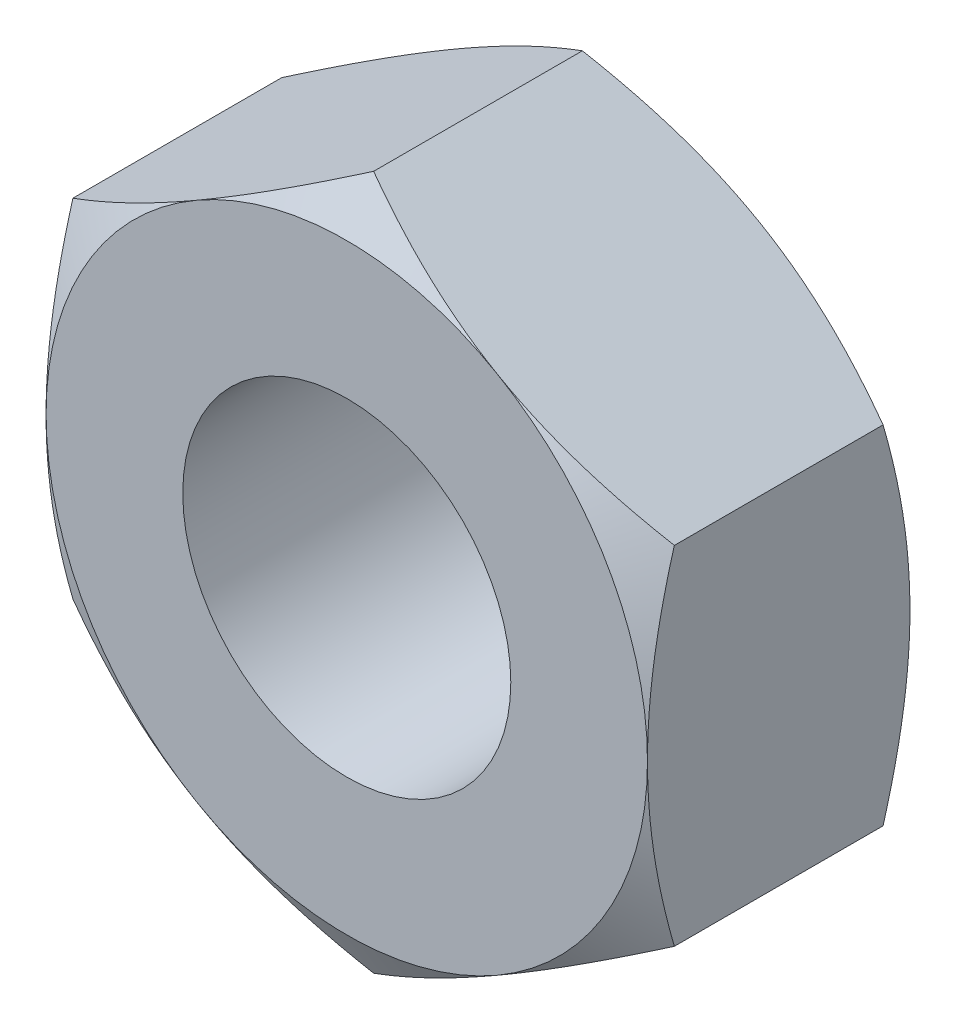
ISO-10303-21;
HEADER;
FILE_DESCRIPTION(('STEP AP214'),'2;1');
FILE_NAME('part.step','',(''),(''),'','','');
FILE_SCHEMA(('AUTOMOTIVE_DESIGN { 1 0 10303 214 1 1 1 1 }'));
ENDSEC;
DATA;
#1=APPLICATION_CONTEXT('core data for automotive mechanical design processes');
#2=APPLICATION_PROTOCOL_DEFINITION('international standard','automotive_design',2000,#1);
#3=PRODUCT_CONTEXT('',#1,'mechanical');
#4=PRODUCT('Part','Part','',(#3));
#5=PRODUCT_RELATED_PRODUCT_CATEGORY('part','',(#4));
#6=PRODUCT_DEFINITION_FORMATION('','',#4);
#7=PRODUCT_DEFINITION_CONTEXT('part definition',#1,'design');
#8=PRODUCT_DEFINITION('design','',#6,#7);
#9=PRODUCT_DEFINITION_SHAPE('','',#8);
#10=(LENGTH_UNIT() NAMED_UNIT(*) SI_UNIT(.MILLI.,.METRE.));
#11=(NAMED_UNIT(*) PLANE_ANGLE_UNIT() SI_UNIT($,.RADIAN.));
#12=(NAMED_UNIT(*) SI_UNIT($,.STERADIAN.) SOLID_ANGLE_UNIT());
#13=UNCERTAINTY_MEASURE_WITH_UNIT(LENGTH_MEASURE(1.E-05),#10,'distance_accuracy_value','');
#14=(GEOMETRIC_REPRESENTATION_CONTEXT(3) GLOBAL_UNCERTAINTY_ASSIGNED_CONTEXT((#13)) GLOBAL_UNIT_ASSIGNED_CONTEXT((#10,
#11,#12)) REPRESENTATION_CONTEXT('',''));
#15=CARTESIAN_POINT('',(0.,0.,0.));
#16=DIRECTION('',(0.,0.,1.));
#17=DIRECTION('',(1.,0.,0.));
#18=AXIS2_PLACEMENT_3D('',#15,#16,#17);
#19=CARTESIAN_POINT('',(-2.75,4.76313972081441,0.));
#20=DIRECTION('',(0.,0.,-1.));
#21=DIRECTION('',(-1.,0.,0.));
#22=AXIS2_PLACEMENT_3D('',#19,#20,#21);
#23=PLANE('',#22);
#24=CARTESIAN_POINT('',(0.,0.,0.));
#25=DIRECTION('',(0.,0.,1.));
#26=DIRECTION('',(1.,0.,0.));
#27=AXIS2_PLACEMENT_3D('',#24,#25,#26);
#28=CIRCLE('',#27,1.5);
#29=CARTESIAN_POINT('',(1.5,0.,0.));
#30=VERTEX_POINT('',#29);
#31=EDGE_CURVE('E331',#30,#30,#28,.T.);
#32=ORIENTED_EDGE('',*,*,#31,.F.);
#33=EDGE_LOOP('',(#32));
#34=FACE_BOUND('',#33,.T.);
#35=CARTESIAN_POINT('',(0.,0.,0.));
#36=DIRECTION('',(0.,0.,-1.));
#37=DIRECTION('',(-1.,0.,0.));
#38=AXIS2_PLACEMENT_3D('',#35,#36,#37);
#39=CIRCLE('',#38,2.75);
#40=CARTESIAN_POINT('',(-2.75,0.,0.));
#41=VERTEX_POINT('',#40);
#42=CARTESIAN_POINT('',(-1.375,2.38156986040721,0.));
#43=VERTEX_POINT('',#42);
#44=EDGE_CURVE('E339',#41,#43,#39,.T.);
#45=ORIENTED_EDGE('',*,*,#44,.F.);
#46=CARTESIAN_POINT('',(0.,0.,0.));
#47=DIRECTION('',(0.,0.,-1.));
#48=DIRECTION('',(-1.,0.,0.));
#49=AXIS2_PLACEMENT_3D('',#46,#47,#48);
#50=CIRCLE('',#49,2.75);
#51=CARTESIAN_POINT('',(-1.375,-2.38156986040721,0.));
#52=VERTEX_POINT('',#51);
#53=EDGE_CURVE('E149',#41,#52,#50,.F.);
#54=ORIENTED_EDGE('',*,*,#53,.T.);
#55=CARTESIAN_POINT('',(1.375,-2.38156986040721,0.));
#56=VERTEX_POINT('',#55);
#57=EDGE_CURVE('E260',#52,#56,#50,.F.);
#58=ORIENTED_EDGE('',*,*,#57,.T.);
#59=CARTESIAN_POINT('',(2.75,0.,0.));
#60=VERTEX_POINT('',#59);
#61=EDGE_CURVE('E152',#56,#60,#50,.F.);
#62=ORIENTED_EDGE('',*,*,#61,.T.);
#63=CARTESIAN_POINT('',(1.375,2.38156986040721,0.));
#64=VERTEX_POINT('',#63);
#65=EDGE_CURVE('E127',#60,#64,#50,.F.);
#66=ORIENTED_EDGE('',*,*,#65,.T.);
#67=EDGE_CURVE('E140',#64,#43,#50,.F.);
#68=ORIENTED_EDGE('',*,*,#67,.T.);
#69=EDGE_LOOP('',(#45,#54,#58,#62,#66,#68));
#70=FACE_BOUND('',#69,.T.);
#71=ADVANCED_FACE('F32',(#34,#70),#23,.F.);
#72=CARTESIAN_POINT('',(0.,0.,0.));
#73=DIRECTION('',(0.,0.,-1.));
#74=DIRECTION('',(-1.,0.,0.));
#75=AXIS2_PLACEMENT_3D('',#72,#73,#74);
#76=CONICAL_SURFACE('',#75,2.75,1.0471975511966);
#77=CARTESIAN_POINT('',(-2.75,-4.34466851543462,-1.38093653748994));
#78=CARTESIAN_POINT('',(-2.75,-4.22386779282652,-1.32202064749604));
#79=CARTESIAN_POINT('',(-2.75,-4.10279820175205,-1.26364700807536));
#80=CARTESIAN_POINT('',(-2.75,-3.85997859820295,-1.14828767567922));
#81=CARTESIAN_POINT('',(-2.75,-3.73822848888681,-1.09130218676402));
#82=CARTESIAN_POINT('',(-2.75,-3.49331526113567,-0.978752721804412));
#83=CARTESIAN_POINT('',(-2.75,-3.37014810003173,-0.923197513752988));
#84=CARTESIAN_POINT('',(-2.75,-3.12286173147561,-0.814256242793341));
#85=CARTESIAN_POINT('',(-2.75,-2.99874256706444,-0.760870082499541));
#86=CARTESIAN_POINT('',(-2.75,-2.74504756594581,-0.655040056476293));
#87=CARTESIAN_POINT('',(-2.75,-2.61543135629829,-0.602692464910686));
#88=CARTESIAN_POINT('',(-2.75,-2.35471222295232,-0.501769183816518));
#89=CARTESIAN_POINT('',(-2.75,-2.22360913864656,-0.453193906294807));
#90=CARTESIAN_POINT('',(-2.75,-1.95992838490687,-0.36103232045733));
#91=CARTESIAN_POINT('',(-2.75,-1.82735405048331,-0.317436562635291));
#92=CARTESIAN_POINT('',(-2.75,-1.56030503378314,-0.236579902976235));
#93=CARTESIAN_POINT('',(-2.75,-1.42583093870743,-0.199317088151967));
#94=CARTESIAN_POINT('',(-2.75,-1.1556720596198,-0.133064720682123));
#95=CARTESIAN_POINT('',(-2.75,-1.01999923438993,-0.104027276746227));
#96=CARTESIAN_POINT('',(-2.75,-0.746885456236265,-0.0558064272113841));
#97=CARTESIAN_POINT('',(-2.75,-0.609444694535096,-0.036621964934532));
#98=CARTESIAN_POINT('',(-2.75,-0.335308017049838,-0.00988438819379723));
#99=CARTESIAN_POINT('',(-2.75,-0.198627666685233,-0.00217562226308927));
#100=CARTESIAN_POINT('',(-2.75,0.0749013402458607,0.00137225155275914));
#101=CARTESIAN_POINT('',(-2.75,0.211749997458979,-0.00278868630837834));
#102=CARTESIAN_POINT('',(-2.75,0.441773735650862,-0.0194575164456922));
#103=CARTESIAN_POINT('',(-2.75,0.53518371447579,-0.0289378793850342));
#104=CARTESIAN_POINT('',(-2.75,0.721369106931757,-0.0528801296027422));
#105=CARTESIAN_POINT('',(-2.75,0.814144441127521,-0.0673426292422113));
#106=CARTESIAN_POINT('',(-2.75,1.09135512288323,-0.117450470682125));
#107=CARTESIAN_POINT('',(-2.75,1.27458276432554,-0.159808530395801));
#108=CARTESIAN_POINT('',(-2.75,1.64148663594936,-0.258901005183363));
#109=CARTESIAN_POINT('',(-2.75,1.82507634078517,-0.315943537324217));
#110=CARTESIAN_POINT('',(-2.75,2.09789706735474,-0.408810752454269));
#111=CARTESIAN_POINT('',(-2.75,2.18840332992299,-0.440981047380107));
#112=CARTESIAN_POINT('',(-2.75,2.36865794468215,-0.507377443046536));
#113=CARTESIAN_POINT('',(-2.75,2.45840631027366,-0.541603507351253));
#114=CARTESIAN_POINT('',(-2.75,2.68603060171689,-0.630917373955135));
#115=CARTESIAN_POINT('',(-2.75,2.82343831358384,-0.687195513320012));
#116=CARTESIAN_POINT('',(-2.75,3.09693392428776,-0.802882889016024));
#117=CARTESIAN_POINT('',(-2.75,3.23302170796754,-0.862292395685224));
#118=CARTESIAN_POINT('',(-2.75,3.50414954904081,-0.983551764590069));
#119=CARTESIAN_POINT('',(-2.75,3.63918929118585,-1.04540232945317));
#120=CARTESIAN_POINT('',(-2.75,3.90838030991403,-1.17101091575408));
#121=CARTESIAN_POINT('',(-2.75,4.0425315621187,-1.23476898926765));
#122=CARTESIAN_POINT('',(-2.75,4.44426655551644,-1.42847314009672));
#123=CARTESIAN_POINT('',(-2.75,4.71075917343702,-1.56067980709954));
#124=CARTESIAN_POINT('',(-2.75,5.24170253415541,-1.82899066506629));
#125=CARTESIAN_POINT('',(-2.75,5.50615362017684,-1.96509418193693));
#126=CARTESIAN_POINT('',(-2.75,6.00831212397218,-2.22681256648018));
#127=CARTESIAN_POINT('',(-2.75,6.24614899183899,-2.35217951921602));
#128=CARTESIAN_POINT('',(-2.75,6.72096497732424,-2.60455330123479));
#129=CARTESIAN_POINT('',(-2.75,6.95794405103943,-2.73156021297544));
#130=CARTESIAN_POINT('',(-2.75,7.43050912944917,-2.986411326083));
#131=CARTESIAN_POINT('',(-2.75,7.66609717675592,-3.11425174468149));
#132=CARTESIAN_POINT('',(-2.75,8.13673290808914,-3.37088488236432));
#133=CARTESIAN_POINT('',(-2.75,8.37178062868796,-3.4996775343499));
#134=CARTESIAN_POINT('',(-2.75,8.60663455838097,-3.62882004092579));
#135=B_SPLINE_CURVE_WITH_KNOTS('',3,(#77,#78,#79,#80,#81,#82,#83,#84,#85,#86,#87,#88,#89,#90,
#91,#92,#93,#94,#95,#96,#97,#98,#99,#100,#101,#102,#103,#104,#105,#106,#107,#108,#109,#110,#111,
#112,#113,#114,#115,#116,#117,#118,#119,#120,#121,#122,#123,#124,#125,#126,#127,#128,#129,#130,
#131,#132,#133,#134),.UNSPECIFIED.,.F.,.F.,(4,2,2,2,2,2,2,2,2,2,2,2,2,2,2,2,2,2,2,2,2,2,2,2,2,2,
2,2,4),(0.,0.403210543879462,0.806480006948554,1.21181340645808,1.61712858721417,
2.03644659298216,2.45581033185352,2.8743645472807,3.29279210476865,3.70873084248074,
4.12462496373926,4.53482497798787,4.94502657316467,5.22656209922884,5.5081322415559,
6.07154931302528,6.64791900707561,6.9360607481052,7.22419738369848,7.66960136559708,
8.11504386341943,8.56061552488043,9.00619936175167,9.89859387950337,10.7908349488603,
11.5973926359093,12.4039910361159,13.2081055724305,14.0121639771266),.UNSPECIFIED.);
#136=CARTESIAN_POINT('',(-2.75,1.58771324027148,-0.245620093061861));
#137=VERTEX_POINT('',#136);
#138=EDGE_CURVE('E157',#137,#41,#135,.F.);
#139=ORIENTED_EDGE('',*,*,#138,.T.);
#140=ORIENTED_EDGE('',*,*,#44,.T.);
#141=CARTESIAN_POINT('',(0.000199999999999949,3.17554195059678,-0.245686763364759));
#142=CARTESIAN_POINT('',(-0.120649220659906,3.10576962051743,-0.205387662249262));
#143=CARTESIAN_POINT('',(-0.242541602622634,3.03539502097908,-0.168736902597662));
#144=CARTESIAN_POINT('',(-0.488437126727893,2.89342717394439,-0.104762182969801));
#145=CARTESIAN_POINT('',(-0.612444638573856,2.82183140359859,-0.0774608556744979));
#146=CARTESIAN_POINT('',(-0.858922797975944,2.67952717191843,-0.0349617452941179));
#147=CARTESIAN_POINT('',(-0.981355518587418,2.60884060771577,-0.0194811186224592));
#148=CARTESIAN_POINT('',(-1.22679714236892,2.46713482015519,-0.000999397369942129));
#149=CARTESIAN_POINT('',(-1.34980515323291,2.39611611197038,0.00201700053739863));
#150=CARTESIAN_POINT('',(-1.57965878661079,2.26341005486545,-0.0042531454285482));
#151=CARTESIAN_POINT('',(-1.68653879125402,2.20170285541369,-0.0120001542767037));
#152=CARTESIAN_POINT('',(-1.89960246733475,2.07869048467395,-0.0365551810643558));
#153=CARTESIAN_POINT('',(-2.00578540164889,2.01738573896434,-0.0533715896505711));
#154=CARTESIAN_POINT('',(-2.21928848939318,1.89411967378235,-0.0954119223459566));
#155=CARTESIAN_POINT('',(-2.32658161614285,1.83217395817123,-0.120814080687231));
#156=CARTESIAN_POINT('',(-2.53956747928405,1.70920651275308,-0.178467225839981));
#157=CARTESIAN_POINT('',(-2.64526294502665,1.64818320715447,-0.210704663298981));
#158=CARTESIAN_POINT('',(-2.7502,1.58759777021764,-0.245686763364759));
#159=B_SPLINE_CURVE_WITH_KNOTS('',3,(#141,#142,#143,#144,#145,#146,#147,#148,#149,#150,#151,
#152,#153,#154,#155,#156,#157,#158),.UNSPECIFIED.,.F.,.F.,(4,2,2,2,2,2,2,2,4),(0.,
0.435912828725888,0.872873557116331,1.29901931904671,1.72464171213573,2.09526089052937,
2.46622354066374,2.84541551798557,3.22386274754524),.UNSPECIFIED.);
#160=EDGE_CURVE('E192',#43,#137,#159,.T.);
#161=ORIENTED_EDGE('',*,*,#160,.T.);
#162=EDGE_LOOP('',(#139,#140,#161));
#163=FACE_BOUND('',#162,.T.);
#164=ADVANCED_FACE('F179',(#163),#76,.T.);
#165=CARTESIAN_POINT('',(2.7502,1.58759777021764,-0.245686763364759));
#166=CARTESIAN_POINT('',(2.62935077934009,1.65737010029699,-0.205387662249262));
#167=CARTESIAN_POINT('',(2.50745839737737,1.72774469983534,-0.168736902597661));
#168=CARTESIAN_POINT('',(2.26156287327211,1.86971254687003,-0.104762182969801));
#169=CARTESIAN_POINT('',(2.13755536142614,1.94130831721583,-0.0774608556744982));
#170=CARTESIAN_POINT('',(1.89107720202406,2.08361254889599,-0.0349617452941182));
#171=CARTESIAN_POINT('',(1.76864448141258,2.15429911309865,-0.0194811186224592));
#172=CARTESIAN_POINT('',(1.52320285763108,2.29600490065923,-0.000999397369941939));
#173=CARTESIAN_POINT('',(1.40019484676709,2.36702360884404,0.00201700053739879));
#174=CARTESIAN_POINT('',(1.17034121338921,2.49972966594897,-0.00425314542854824));
#175=CARTESIAN_POINT('',(1.06346120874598,2.56143686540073,-0.0120001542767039));
#176=CARTESIAN_POINT('',(0.85039753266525,2.68444923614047,-0.0365551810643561));
#177=CARTESIAN_POINT('',(0.744214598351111,2.74575398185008,-0.0533715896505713));
#178=CARTESIAN_POINT('',(0.530711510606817,2.86902004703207,-0.0954119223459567));
#179=CARTESIAN_POINT('',(0.423418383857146,2.93096576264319,-0.120814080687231));
#180=CARTESIAN_POINT('',(0.210432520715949,3.05393320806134,-0.178467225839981));
#181=CARTESIAN_POINT('',(0.104737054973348,3.11495651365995,-0.210704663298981));
#182=CARTESIAN_POINT('',(-0.000199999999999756,3.17554195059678,-0.245686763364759));
#183=B_SPLINE_CURVE_WITH_KNOTS('',3,(#165,#166,#167,#168,#169,#170,#171,#172,#173,#174,#175,
#176,#177,#178,#179,#180,#181,#182),.UNSPECIFIED.,.F.,.F.,(4,2,2,2,2,2,2,2,4),(0.,
0.435912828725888,0.872873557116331,1.29901931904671,1.72464171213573,2.09526089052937,
2.46622354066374,2.84541551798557,3.22386274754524),.UNSPECIFIED.);
#184=CARTESIAN_POINT('',(0.,3.17542648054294,-0.245620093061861));
#185=VERTEX_POINT('',#184);
#186=EDGE_CURVE('E136',#64,#185,#183,.T.);
#187=ORIENTED_EDGE('',*,*,#186,.T.);
#188=EDGE_CURVE('E143',#185,#43,#159,.T.);
#189=ORIENTED_EDGE('',*,*,#188,.T.);
#190=ORIENTED_EDGE('',*,*,#67,.F.);
#191=EDGE_LOOP('',(#187,#189,#190));
#192=FACE_BOUND('',#191,.T.);
#193=ADVANCED_FACE('F141',(#192),#76,.T.);
#194=CARTESIAN_POINT('',(2.75,-4.34466851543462,-1.38093653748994));
#195=CARTESIAN_POINT('',(2.75,-4.22386779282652,-1.32202064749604));
#196=CARTESIAN_POINT('',(2.75,-4.10279820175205,-1.26364700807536));
#197=CARTESIAN_POINT('',(2.75,-3.85997859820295,-1.14828767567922));
#198=CARTESIAN_POINT('',(2.75,-3.73822848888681,-1.09130218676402));
#199=CARTESIAN_POINT('',(2.75,-3.49331526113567,-0.978752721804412));
#200=CARTESIAN_POINT('',(2.75,-3.37014810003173,-0.923197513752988));
#201=CARTESIAN_POINT('',(2.75,-3.12286173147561,-0.814256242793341));
#202=CARTESIAN_POINT('',(2.75,-2.99874256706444,-0.760870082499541));
#203=CARTESIAN_POINT('',(2.75,-2.74504756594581,-0.655040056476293));
#204=CARTESIAN_POINT('',(2.75,-2.61543135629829,-0.602692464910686));
#205=CARTESIAN_POINT('',(2.75,-2.35471222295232,-0.501769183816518));
#206=CARTESIAN_POINT('',(2.75,-2.22360913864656,-0.453193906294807));
#207=CARTESIAN_POINT('',(2.75,-1.95992838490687,-0.36103232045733));
#208=CARTESIAN_POINT('',(2.75,-1.82735405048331,-0.317436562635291));
#209=CARTESIAN_POINT('',(2.75,-1.56030503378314,-0.236579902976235));
#210=CARTESIAN_POINT('',(2.75,-1.42583093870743,-0.199317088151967));
#211=CARTESIAN_POINT('',(2.75,-1.1556720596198,-0.133064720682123));
#212=CARTESIAN_POINT('',(2.75,-1.01999923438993,-0.104027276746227));
#213=CARTESIAN_POINT('',(2.75,-0.746885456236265,-0.0558064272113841));
#214=CARTESIAN_POINT('',(2.75,-0.609444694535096,-0.036621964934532));
#215=CARTESIAN_POINT('',(2.75,-0.335308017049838,-0.00988438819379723));
#216=CARTESIAN_POINT('',(2.75,-0.198627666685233,-0.00217562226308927));
#217=CARTESIAN_POINT('',(2.75,0.0749013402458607,0.00137225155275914));
#218=CARTESIAN_POINT('',(2.75,0.211749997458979,-0.00278868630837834));
#219=CARTESIAN_POINT('',(2.75,0.441773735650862,-0.0194575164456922));
#220=CARTESIAN_POINT('',(2.75,0.53518371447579,-0.0289378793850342));
#221=CARTESIAN_POINT('',(2.75,0.721369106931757,-0.0528801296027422));
#222=CARTESIAN_POINT('',(2.75,0.814144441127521,-0.0673426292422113));
#223=CARTESIAN_POINT('',(2.75,1.09135512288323,-0.117450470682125));
#224=CARTESIAN_POINT('',(2.75,1.27458276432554,-0.159808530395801));
#225=CARTESIAN_POINT('',(2.75,1.64148663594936,-0.258901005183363));
#226=CARTESIAN_POINT('',(2.75,1.82507634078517,-0.315943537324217));
#227=CARTESIAN_POINT('',(2.75,2.09789706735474,-0.408810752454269));
#228=CARTESIAN_POINT('',(2.75,2.18840332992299,-0.440981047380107));
#229=CARTESIAN_POINT('',(2.75,2.36865794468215,-0.507377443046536));
#230=CARTESIAN_POINT('',(2.75,2.45840631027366,-0.541603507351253));
#231=CARTESIAN_POINT('',(2.75,2.68603060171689,-0.630917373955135));
#232=CARTESIAN_POINT('',(2.75,2.82343831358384,-0.687195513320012));
#233=CARTESIAN_POINT('',(2.75,3.09693392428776,-0.802882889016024));
#234=CARTESIAN_POINT('',(2.75,3.23302170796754,-0.862292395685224));
#235=CARTESIAN_POINT('',(2.75,3.50414954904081,-0.983551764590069));
#236=CARTESIAN_POINT('',(2.75,3.63918929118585,-1.04540232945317));
#237=CARTESIAN_POINT('',(2.75,3.90838030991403,-1.17101091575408));
#238=CARTESIAN_POINT('',(2.75,4.0425315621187,-1.23476898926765));
#239=CARTESIAN_POINT('',(2.75,4.44426655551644,-1.42847314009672));
#240=CARTESIAN_POINT('',(2.75,4.71075917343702,-1.56067980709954));
#241=CARTESIAN_POINT('',(2.75,5.24170253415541,-1.82899066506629));
#242=CARTESIAN_POINT('',(2.75,5.50615362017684,-1.96509418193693));
#243=CARTESIAN_POINT('',(2.75,6.00831212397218,-2.22681256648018));
#244=CARTESIAN_POINT('',(2.75,6.24614899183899,-2.35217951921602));
#245=CARTESIAN_POINT('',(2.75,6.72096497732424,-2.60455330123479));
#246=CARTESIAN_POINT('',(2.75,6.95794405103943,-2.73156021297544));
#247=CARTESIAN_POINT('',(2.75,7.43050912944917,-2.986411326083));
#248=CARTESIAN_POINT('',(2.75,7.66609717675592,-3.11425174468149));
#249=CARTESIAN_POINT('',(2.75,8.13673290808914,-3.37088488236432));
#250=CARTESIAN_POINT('',(2.75,8.37178062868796,-3.4996775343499));
#251=CARTESIAN_POINT('',(2.75,8.60663455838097,-3.62882004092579));
#252=B_SPLINE_CURVE_WITH_KNOTS('',3,(#194,#195,#196,#197,#198,#199,#200,#201,#202,#203,#204,
#205,#206,#207,#208,#209,#210,#211,#212,#213,#214,#215,#216,#217,#218,#219,#220,#221,#222,#223,
#224,#225,#226,#227,#228,#229,#230,#231,#232,#233,#234,#235,#236,#237,#238,#239,#240,#241,#242,
#243,#244,#245,#246,#247,#248,#249,#250,#251),.UNSPECIFIED.,.F.,.F.,(4,2,2,2,2,2,2,2,2,2,2,2,2,
2,2,2,2,2,2,2,2,2,2,2,2,2,2,2,4),(0.,0.403210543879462,0.806480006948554,1.21181340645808,
1.61712858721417,2.03644659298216,2.45581033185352,2.8743645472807,3.29279210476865,
3.70873084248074,4.12462496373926,4.53482497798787,4.94502657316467,5.22656209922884,
5.5081322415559,6.07154931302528,6.64791900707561,6.9360607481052,7.22419738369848,
7.66960136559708,8.11504386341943,8.56061552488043,9.00619936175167,9.89859387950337,
10.7908349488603,11.5973926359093,12.4039910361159,13.2081055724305,14.0121639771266),.UNSPECIFIED.);
#253=CARTESIAN_POINT('',(2.75,1.58771324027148,-0.245620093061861));
#254=VERTEX_POINT('',#253);
#255=EDGE_CURVE('E130',#60,#254,#252,.T.);
#256=ORIENTED_EDGE('',*,*,#255,.T.);
#257=EDGE_CURVE('E123',#254,#64,#183,.T.);
#258=ORIENTED_EDGE('',*,*,#257,.T.);
#259=ORIENTED_EDGE('',*,*,#65,.F.);
#260=EDGE_LOOP('',(#256,#258,#259));
#261=FACE_BOUND('',#260,.T.);
#262=ADVANCED_FACE('F125',(#261),#76,.T.);
#263=CARTESIAN_POINT('',(-0.000199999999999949,-3.17554195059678,-0.245686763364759));
#264=CARTESIAN_POINT('',(0.120649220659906,-3.10576962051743,-0.205387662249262));
#265=CARTESIAN_POINT('',(0.242541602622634,-3.03539502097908,-0.168736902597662));
#266=CARTESIAN_POINT('',(0.488437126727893,-2.89342717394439,-0.104762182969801));
#267=CARTESIAN_POINT('',(0.612444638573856,-2.82183140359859,-0.0774608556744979));
#268=CARTESIAN_POINT('',(0.858922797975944,-2.67952717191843,-0.0349617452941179));
#269=CARTESIAN_POINT('',(0.981355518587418,-2.60884060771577,-0.0194811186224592));
#270=CARTESIAN_POINT('',(1.22679714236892,-2.46713482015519,-0.000999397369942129));
#271=CARTESIAN_POINT('',(1.34980515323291,-2.39611611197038,0.00201700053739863));
#272=CARTESIAN_POINT('',(1.57965878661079,-2.26341005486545,-0.0042531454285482));
#273=CARTESIAN_POINT('',(1.68653879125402,-2.20170285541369,-0.0120001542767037));
#274=CARTESIAN_POINT('',(1.89960246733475,-2.07869048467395,-0.0365551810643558));
#275=CARTESIAN_POINT('',(2.00578540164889,-2.01738573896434,-0.0533715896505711));
#276=CARTESIAN_POINT('',(2.21928848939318,-1.89411967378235,-0.0954119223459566));
#277=CARTESIAN_POINT('',(2.32658161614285,-1.83217395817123,-0.120814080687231));
#278=CARTESIAN_POINT('',(2.53956747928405,-1.70920651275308,-0.178467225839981));
#279=CARTESIAN_POINT('',(2.64526294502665,-1.64818320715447,-0.210704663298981));
#280=CARTESIAN_POINT('',(2.7502,-1.58759777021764,-0.245686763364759));
#281=B_SPLINE_CURVE_WITH_KNOTS('',3,(#263,#264,#265,#266,#267,#268,#269,#270,#271,#272,#273,
#274,#275,#276,#277,#278,#279,#280),.UNSPECIFIED.,.F.,.F.,(4,2,2,2,2,2,2,2,4),(0.,
0.435912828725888,0.872873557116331,1.29901931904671,1.72464171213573,2.09526089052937,
2.46622354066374,2.84541551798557,3.22386274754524),.UNSPECIFIED.);
#282=CARTESIAN_POINT('',(2.75,-1.58771324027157,-0.245620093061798));
#283=VERTEX_POINT('',#282);
#284=EDGE_CURVE('E208',#56,#283,#281,.T.);
#285=ORIENTED_EDGE('',*,*,#284,.T.);
#286=EDGE_CURVE('E207',#283,#60,#252,.T.);
#287=ORIENTED_EDGE('',*,*,#286,.T.);
#288=ORIENTED_EDGE('',*,*,#61,.F.);
#289=EDGE_LOOP('',(#285,#287,#288));
#290=FACE_BOUND('',#289,.T.);
#291=ADVANCED_FACE('F439',(#290),#76,.T.);
#292=CARTESIAN_POINT('',(0.,-3.17542648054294,-0.245620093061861));
#293=VERTEX_POINT('',#292);
#294=EDGE_CURVE('E270',#293,#56,#281,.T.);
#295=ORIENTED_EDGE('',*,*,#294,.T.);
#296=ORIENTED_EDGE('',*,*,#57,.F.);
#297=CARTESIAN_POINT('',(-2.7502,-1.58759777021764,-0.245686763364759));
#298=CARTESIAN_POINT('',(-2.62935077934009,-1.65737010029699,-0.205387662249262));
#299=CARTESIAN_POINT('',(-2.50745839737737,-1.72774469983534,-0.168736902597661));
#300=CARTESIAN_POINT('',(-2.26156287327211,-1.86971254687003,-0.104762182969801));
#301=CARTESIAN_POINT('',(-2.13755536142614,-1.94130831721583,-0.0774608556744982));
#302=CARTESIAN_POINT('',(-1.89107720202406,-2.08361254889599,-0.0349617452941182));
#303=CARTESIAN_POINT('',(-1.76864448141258,-2.15429911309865,-0.0194811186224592));
#304=CARTESIAN_POINT('',(-1.52320285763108,-2.29600490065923,-0.000999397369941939));
#305=CARTESIAN_POINT('',(-1.40019484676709,-2.36702360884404,0.00201700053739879));
#306=CARTESIAN_POINT('',(-1.17034121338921,-2.49972966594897,-0.00425314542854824));
#307=CARTESIAN_POINT('',(-1.06346120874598,-2.56143686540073,-0.0120001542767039));
#308=CARTESIAN_POINT('',(-0.85039753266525,-2.68444923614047,-0.0365551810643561));
#309=CARTESIAN_POINT('',(-0.744214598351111,-2.74575398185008,-0.0533715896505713));
#310=CARTESIAN_POINT('',(-0.530711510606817,-2.86902004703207,-0.0954119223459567));
#311=CARTESIAN_POINT('',(-0.423418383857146,-2.93096576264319,-0.120814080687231));
#312=CARTESIAN_POINT('',(-0.210432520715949,-3.05393320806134,-0.178467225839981));
#313=CARTESIAN_POINT('',(-0.104737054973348,-3.11495651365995,-0.210704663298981));
#314=CARTESIAN_POINT('',(0.000199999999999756,-3.17554195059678,-0.245686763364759));
#315=B_SPLINE_CURVE_WITH_KNOTS('',3,(#297,#298,#299,#300,#301,#302,#303,#304,#305,#306,#307,
#308,#309,#310,#311,#312,#313,#314),.UNSPECIFIED.,.F.,.F.,(4,2,2,2,2,2,2,2,4),(0.,
0.435912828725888,0.872873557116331,1.29901931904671,1.72464171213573,2.09526089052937,
2.46622354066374,2.84541551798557,3.22386274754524),.UNSPECIFIED.);
#316=EDGE_CURVE('E274',#52,#293,#315,.T.);
#317=ORIENTED_EDGE('',*,*,#316,.T.);
#318=EDGE_LOOP('',(#295,#296,#317));
#319=FACE_BOUND('',#318,.T.);
#320=ADVANCED_FACE('F185',(#319),#76,.T.);
#321=CARTESIAN_POINT('',(-2.75,-1.58771324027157,-0.245620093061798));
#322=VERTEX_POINT('',#321);
#323=EDGE_CURVE('E172',#322,#52,#315,.T.);
#324=ORIENTED_EDGE('',*,*,#323,.T.);
#325=ORIENTED_EDGE('',*,*,#53,.F.);
#326=EDGE_CURVE('E135',#41,#322,#135,.F.);
#327=ORIENTED_EDGE('',*,*,#326,.T.);
#328=EDGE_LOOP('',(#324,#325,#327));
#329=FACE_BOUND('',#328,.T.);
#330=ADVANCED_FACE('F279',(#329),#76,.T.);
#331=CARTESIAN_POINT('',(2.75,1.58771324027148,-2.4));
#332=DIRECTION('',(0.499999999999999,0.866025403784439,0.));
#333=DIRECTION('',(-0.866025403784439,0.499999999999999,0.));
#334=AXIS2_PLACEMENT_3D('',#331,#332,#333);
#335=PLANE('',#334);
#336=CARTESIAN_POINT('',(-0.000199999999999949,3.17554195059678,-2.15431323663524));
#337=CARTESIAN_POINT('',(0.120649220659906,3.10576962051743,-2.19461233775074));
#338=CARTESIAN_POINT('',(0.242541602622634,3.03539502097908,-2.23126309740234));
#339=CARTESIAN_POINT('',(0.488437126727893,2.89342717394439,-2.2952378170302));
#340=CARTESIAN_POINT('',(0.612444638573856,2.82183140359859,-2.3225391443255));
#341=CARTESIAN_POINT('',(0.858922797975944,2.67952717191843,-2.36503825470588));
#342=CARTESIAN_POINT('',(0.981355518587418,2.60884060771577,-2.38051888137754));
#343=CARTESIAN_POINT('',(1.22679714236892,2.46713482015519,-2.39900060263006));
#344=CARTESIAN_POINT('',(1.34980515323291,2.39611611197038,-2.4020170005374));
#345=CARTESIAN_POINT('',(1.57965878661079,2.26341005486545,-2.39574685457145));
#346=CARTESIAN_POINT('',(1.68653879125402,2.20170285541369,-2.3879998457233));
#347=CARTESIAN_POINT('',(1.89960246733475,2.07869048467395,-2.36344481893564));
#348=CARTESIAN_POINT('',(2.00578540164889,2.01738573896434,-2.34662841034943));
#349=CARTESIAN_POINT('',(2.21928848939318,1.89411967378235,-2.30458807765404));
#350=CARTESIAN_POINT('',(2.32658161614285,1.83217395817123,-2.27918591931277));
#351=CARTESIAN_POINT('',(2.53956747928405,1.70920651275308,-2.22153277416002));
#352=CARTESIAN_POINT('',(2.64526294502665,1.64818320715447,-2.18929533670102));
#353=CARTESIAN_POINT('',(2.7502,1.58759777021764,-2.15431323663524));
#354=B_SPLINE_CURVE_WITH_KNOTS('',3,(#336,#337,#338,#339,#340,#341,#342,#343,#344,#345,#346,
#347,#348,#349,#350,#351,#352,#353),.UNSPECIFIED.,.F.,.F.,(4,2,2,2,2,2,2,2,4),(0.,
0.435912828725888,0.872873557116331,1.29901931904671,1.72464171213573,2.09526089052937,
2.46622354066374,2.84541551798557,3.22386274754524),.UNSPECIFIED.);
#355=CARTESIAN_POINT('',(0.,3.17542648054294,-2.15437990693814));
#356=VERTEX_POINT('',#355);
#357=CARTESIAN_POINT('',(1.375,2.38156986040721,-2.4));
#358=VERTEX_POINT('',#357);
#359=EDGE_CURVE('E245',#356,#358,#354,.T.);
#360=ORIENTED_EDGE('',*,*,#359,.F.);
#361=DIRECTION('',(0.,0.,1.));
#362=VECTOR('',#361,1.);
#363=CARTESIAN_POINT('',(0.,3.17542648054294,-2.4));
#364=LINE('',#363,#362);
#365=EDGE_CURVE('E156',#356,#185,#364,.T.);
#366=ORIENTED_EDGE('',*,*,#365,.T.);
#367=ORIENTED_EDGE('',*,*,#186,.F.);
#368=ORIENTED_EDGE('',*,*,#257,.F.);
#369=DIRECTION('',(0.,0.,1.));
#370=VECTOR('',#369,1.);
#371=CARTESIAN_POINT('',(2.75,1.58771324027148,-2.4));
#372=LINE('',#371,#370);
#373=CARTESIAN_POINT('',(2.75,1.58771324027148,-2.15437990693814));
#374=VERTEX_POINT('',#373);
#375=EDGE_CURVE('E148',#374,#254,#372,.T.);
#376=ORIENTED_EDGE('',*,*,#375,.F.);
#377=EDGE_CURVE('E239',#358,#374,#354,.T.);
#378=ORIENTED_EDGE('',*,*,#377,.F.);
#379=EDGE_LOOP('',(#360,#366,#367,#368,#376,#378));
#380=FACE_BOUND('',#379,.T.);
#381=ADVANCED_FACE('F34',(#380),#335,.T.);
#382=CARTESIAN_POINT('',(2.75,-1.58771324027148,-2.4));
#383=DIRECTION('',(1.,0.,0.));
#384=DIRECTION('',(0.,0.,-1.));
#385=AXIS2_PLACEMENT_3D('',#382,#383,#384);
#386=PLANE('',#385);
#387=CARTESIAN_POINT('',(2.75,-4.34466851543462,-1.01906346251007));
#388=CARTESIAN_POINT('',(2.75,-4.22386779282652,-1.07797935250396));
#389=CARTESIAN_POINT('',(2.75,-4.10279820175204,-1.13635299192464));
#390=CARTESIAN_POINT('',(2.75,-3.85997859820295,-1.25171232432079));
#391=CARTESIAN_POINT('',(2.75,-3.73822848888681,-1.30869781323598));
#392=CARTESIAN_POINT('',(2.75,-3.49331526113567,-1.42124727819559));
#393=CARTESIAN_POINT('',(2.75,-3.37014810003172,-1.47680248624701));
#394=CARTESIAN_POINT('',(2.75,-3.1228617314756,-1.58574375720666));
#395=CARTESIAN_POINT('',(2.75,-2.99874256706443,-1.63912991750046));
#396=CARTESIAN_POINT('',(2.75,-2.74504756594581,-1.74495994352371));
#397=CARTESIAN_POINT('',(2.75,-2.61543135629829,-1.79730753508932));
#398=CARTESIAN_POINT('',(2.75,-2.35471222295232,-1.89823081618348));
#399=CARTESIAN_POINT('',(2.75,-2.22360913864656,-1.94680609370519));
#400=CARTESIAN_POINT('',(2.75,-1.95992838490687,-2.03896767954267));
#401=CARTESIAN_POINT('',(2.75,-1.82735405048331,-2.08256343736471));
#402=CARTESIAN_POINT('',(2.75,-1.56030503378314,-2.16342009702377));
#403=CARTESIAN_POINT('',(2.75,-1.42583093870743,-2.20068291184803));
#404=CARTESIAN_POINT('',(2.75,-1.1556720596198,-2.26693527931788));
#405=CARTESIAN_POINT('',(2.75,-1.01999923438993,-2.29597272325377));
#406=CARTESIAN_POINT('',(2.75,-0.746885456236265,-2.34419357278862));
#407=CARTESIAN_POINT('',(2.75,-0.609444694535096,-2.36337803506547));
#408=CARTESIAN_POINT('',(2.75,-0.335308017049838,-2.3901156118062));
#409=CARTESIAN_POINT('',(2.75,-0.198627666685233,-2.39782437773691));
#410=CARTESIAN_POINT('',(2.75,0.0749013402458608,-2.40137225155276));
#411=CARTESIAN_POINT('',(2.75,0.211749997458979,-2.39721131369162));
#412=CARTESIAN_POINT('',(2.75,0.441773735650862,-2.38054248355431));
#413=CARTESIAN_POINT('',(2.75,0.53518371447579,-2.37106212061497));
#414=CARTESIAN_POINT('',(2.75,0.721369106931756,-2.34711987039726));
#415=CARTESIAN_POINT('',(2.75,0.81414444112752,-2.33265737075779));
#416=CARTESIAN_POINT('',(2.75,1.09135512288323,-2.28254952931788));
#417=CARTESIAN_POINT('',(2.75,1.27458276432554,-2.2401914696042));
#418=CARTESIAN_POINT('',(2.75,1.64148663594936,-2.14109899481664));
#419=CARTESIAN_POINT('',(2.75,1.82507634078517,-2.08405646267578));
#420=CARTESIAN_POINT('',(2.75,2.09789706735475,-1.99118924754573));
#421=CARTESIAN_POINT('',(2.75,2.188403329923,-1.95901895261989));
#422=CARTESIAN_POINT('',(2.75,2.36865794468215,-1.89262255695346));
#423=CARTESIAN_POINT('',(2.75,2.45840631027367,-1.85839649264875));
#424=CARTESIAN_POINT('',(2.75,2.6860306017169,-1.76908262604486));
#425=CARTESIAN_POINT('',(2.75,2.82343831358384,-1.71280448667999));
#426=CARTESIAN_POINT('',(2.75,3.09693392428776,-1.59711711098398));
#427=CARTESIAN_POINT('',(2.75,3.23302170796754,-1.53770760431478));
#428=CARTESIAN_POINT('',(2.75,3.50414954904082,-1.41644823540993));
#429=CARTESIAN_POINT('',(2.75,3.63918929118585,-1.35459767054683));
#430=CARTESIAN_POINT('',(2.75,3.90838030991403,-1.22898908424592));
#431=CARTESIAN_POINT('',(2.75,4.04253156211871,-1.16523101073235));
#432=CARTESIAN_POINT('',(2.75,4.44426655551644,-0.971526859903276));
#433=CARTESIAN_POINT('',(2.75,4.71075917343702,-0.839320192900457));
#434=CARTESIAN_POINT('',(2.75,5.24170253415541,-0.571009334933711));
#435=CARTESIAN_POINT('',(2.75,5.50615362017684,-0.434905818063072));
#436=CARTESIAN_POINT('',(2.75,6.00831212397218,-0.173187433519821));
#437=CARTESIAN_POINT('',(2.75,6.24614899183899,-0.0478204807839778));
#438=CARTESIAN_POINT('',(2.75,6.72096497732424,0.204553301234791));
#439=CARTESIAN_POINT('',(2.75,6.95794405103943,0.331560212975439));
#440=CARTESIAN_POINT('',(2.75,7.43050912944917,0.586411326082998));
#441=CARTESIAN_POINT('',(2.75,7.66609717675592,0.714251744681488));
#442=CARTESIAN_POINT('',(2.75,8.13673290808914,0.970884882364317));
#443=CARTESIAN_POINT('',(2.75,8.37178062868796,1.0996775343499));
#444=CARTESIAN_POINT('',(2.75,8.60663455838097,1.22882004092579));
#445=B_SPLINE_CURVE_WITH_KNOTS('',3,(#387,#388,#389,#390,#391,#392,#393,#394,#395,#396,#397,
#398,#399,#400,#401,#402,#403,#404,#405,#406,#407,#408,#409,#410,#411,#412,#413,#414,#415,#416,
#417,#418,#419,#420,#421,#422,#423,#424,#425,#426,#427,#428,#429,#430,#431,#432,#433,#434,#435,
#436,#437,#438,#439,#440,#441,#442,#443,#444),.UNSPECIFIED.,.F.,.F.,(4,2,2,2,2,2,2,2,2,2,2,2,2,
2,2,2,2,2,2,2,2,2,2,2,2,2,2,2,4),(0.,0.403210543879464,0.806480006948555,1.21181340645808,
1.61712858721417,2.03644659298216,2.45581033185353,2.8743645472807,3.29279210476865,
3.70873084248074,4.12462496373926,4.53482497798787,4.94502657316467,5.22656209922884,
5.5081322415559,6.07154931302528,6.64791900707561,6.9360607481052,7.22419738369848,
7.66960136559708,8.11504386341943,8.56061552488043,9.00619936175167,9.89859387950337,
10.7908349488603,11.5973926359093,12.4039910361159,13.2081055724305,14.0121639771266),.UNSPECIFIED.);
#446=CARTESIAN_POINT('',(2.75,0.,-2.4));
#447=VERTEX_POINT('',#446);
#448=EDGE_CURVE('E232',#374,#447,#445,.F.);
#449=ORIENTED_EDGE('',*,*,#448,.F.);
#450=ORIENTED_EDGE('',*,*,#375,.T.);
#451=ORIENTED_EDGE('',*,*,#255,.F.);
#452=ORIENTED_EDGE('',*,*,#286,.F.);
#453=DIRECTION('',(0.,0.,1.));
#454=VECTOR('',#453,1.);
#455=CARTESIAN_POINT('',(2.75,-1.58771324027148,-2.4));
#456=LINE('',#455,#454);
#457=CARTESIAN_POINT('',(2.75,-1.58771324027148,-2.15437990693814));
#458=VERTEX_POINT('',#457);
#459=EDGE_CURVE('E247',#458,#283,#456,.T.);
#460=ORIENTED_EDGE('',*,*,#459,.F.);
#461=EDGE_CURVE('E225',#447,#458,#445,.F.);
#462=ORIENTED_EDGE('',*,*,#461,.F.);
#463=EDGE_LOOP('',(#449,#450,#451,#452,#460,#462));
#464=FACE_BOUND('',#463,.T.);
#465=ADVANCED_FACE('F215',(#464),#386,.T.);
#466=CARTESIAN_POINT('',(2.75,-1.58771324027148,-2.4));
#467=DIRECTION('',(0.499999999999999,-0.866025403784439,0.));
#468=DIRECTION('',(0.866025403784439,0.499999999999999,0.));
#469=AXIS2_PLACEMENT_3D('',#466,#467,#468);
#470=PLANE('',#469);
#471=CARTESIAN_POINT('',(2.7502,-1.58759777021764,-2.15431323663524));
#472=CARTESIAN_POINT('',(2.62935077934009,-1.65737010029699,-2.19461233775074));
#473=CARTESIAN_POINT('',(2.50745839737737,-1.72774469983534,-2.23126309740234));
#474=CARTESIAN_POINT('',(2.26156287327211,-1.86971254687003,-2.2952378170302));
#475=CARTESIAN_POINT('',(2.13755536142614,-1.94130831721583,-2.3225391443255));
#476=CARTESIAN_POINT('',(1.89107720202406,-2.08361254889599,-2.36503825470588));
#477=CARTESIAN_POINT('',(1.76864448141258,-2.15429911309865,-2.38051888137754));
#478=CARTESIAN_POINT('',(1.52320285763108,-2.29600490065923,-2.39900060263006));
#479=CARTESIAN_POINT('',(1.40019484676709,-2.36702360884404,-2.4020170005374));
#480=CARTESIAN_POINT('',(1.17034121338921,-2.49972966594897,-2.39574685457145));
#481=CARTESIAN_POINT('',(1.06346120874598,-2.56143686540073,-2.3879998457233));
#482=CARTESIAN_POINT('',(0.85039753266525,-2.68444923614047,-2.36344481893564));
#483=CARTESIAN_POINT('',(0.744214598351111,-2.74575398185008,-2.34662841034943));
#484=CARTESIAN_POINT('',(0.530711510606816,-2.86902004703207,-2.30458807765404));
#485=CARTESIAN_POINT('',(0.423418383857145,-2.93096576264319,-2.27918591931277));
#486=CARTESIAN_POINT('',(0.210432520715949,-3.05393320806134,-2.22153277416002));
#487=CARTESIAN_POINT('',(0.104737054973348,-3.11495651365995,-2.18929533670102));
#488=CARTESIAN_POINT('',(-0.000199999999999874,-3.17554195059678,-2.15431323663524));
#489=B_SPLINE_CURVE_WITH_KNOTS('',3,(#471,#472,#473,#474,#475,#476,#477,#478,#479,#480,#481,
#482,#483,#484,#485,#486,#487,#488),.UNSPECIFIED.,.F.,.F.,(4,2,2,2,2,2,2,2,4),(0.,
0.435912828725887,0.872873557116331,1.29901931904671,1.72464171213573,2.09526089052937,
2.46622354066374,2.84541551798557,3.22386274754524),.UNSPECIFIED.);
#490=CARTESIAN_POINT('',(1.375,-2.38156986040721,-2.4));
#491=VERTEX_POINT('',#490);
#492=EDGE_CURVE('E56',#458,#491,#489,.T.);
#493=ORIENTED_EDGE('',*,*,#492,.F.);
#494=ORIENTED_EDGE('',*,*,#459,.T.);
#495=ORIENTED_EDGE('',*,*,#284,.F.);
#496=ORIENTED_EDGE('',*,*,#294,.F.);
#497=DIRECTION('',(0.,0.,1.));
#498=VECTOR('',#497,1.);
#499=CARTESIAN_POINT('',(0.,-3.17542648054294,-2.4));
#500=LINE('',#499,#498);
#501=CARTESIAN_POINT('',(0.,-3.17542648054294,-2.15437990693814));
#502=VERTEX_POINT('',#501);
#503=EDGE_CURVE('E250',#502,#293,#500,.T.);
#504=ORIENTED_EDGE('',*,*,#503,.F.);
#505=EDGE_CURVE('E233',#491,#502,#489,.T.);
#506=ORIENTED_EDGE('',*,*,#505,.F.);
#507=EDGE_LOOP('',(#493,#494,#495,#496,#504,#506));
#508=FACE_BOUND('',#507,.T.);
#509=ADVANCED_FACE('F219',(#508),#470,.T.);
#510=CARTESIAN_POINT('',(-2.75,-1.58771324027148,-2.4));
#511=DIRECTION('',(-0.499999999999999,-0.866025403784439,0.));
#512=DIRECTION('',(0.866025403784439,-0.499999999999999,0.));
#513=AXIS2_PLACEMENT_3D('',#510,#511,#512);
#514=PLANE('',#513);
#515=CARTESIAN_POINT('',(0.000199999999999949,-3.17554195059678,-2.15431323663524));
#516=CARTESIAN_POINT('',(-0.120649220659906,-3.10576962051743,-2.19461233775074));
#517=CARTESIAN_POINT('',(-0.242541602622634,-3.03539502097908,-2.23126309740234));
#518=CARTESIAN_POINT('',(-0.488437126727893,-2.89342717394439,-2.2952378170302));
#519=CARTESIAN_POINT('',(-0.612444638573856,-2.82183140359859,-2.3225391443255));
#520=CARTESIAN_POINT('',(-0.858922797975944,-2.67952717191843,-2.36503825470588));
#521=CARTESIAN_POINT('',(-0.981355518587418,-2.60884060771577,-2.38051888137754));
#522=CARTESIAN_POINT('',(-1.22679714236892,-2.46713482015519,-2.39900060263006));
#523=CARTESIAN_POINT('',(-1.34980515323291,-2.39611611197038,-2.4020170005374));
#524=CARTESIAN_POINT('',(-1.57965878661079,-2.26341005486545,-2.39574685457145));
#525=CARTESIAN_POINT('',(-1.68653879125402,-2.20170285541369,-2.3879998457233));
#526=CARTESIAN_POINT('',(-1.89960246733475,-2.07869048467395,-2.36344481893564));
#527=CARTESIAN_POINT('',(-2.00578540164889,-2.01738573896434,-2.34662841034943));
#528=CARTESIAN_POINT('',(-2.21928848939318,-1.89411967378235,-2.30458807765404));
#529=CARTESIAN_POINT('',(-2.32658161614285,-1.83217395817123,-2.27918591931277));
#530=CARTESIAN_POINT('',(-2.53956747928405,-1.70920651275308,-2.22153277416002));
#531=CARTESIAN_POINT('',(-2.64526294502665,-1.64818320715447,-2.18929533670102));
#532=CARTESIAN_POINT('',(-2.7502,-1.58759777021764,-2.15431323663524));
#533=B_SPLINE_CURVE_WITH_KNOTS('',3,(#515,#516,#517,#518,#519,#520,#521,#522,#523,#524,#525,
#526,#527,#528,#529,#530,#531,#532),.UNSPECIFIED.,.F.,.F.,(4,2,2,2,2,2,2,2,4),(0.,
0.435912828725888,0.872873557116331,1.29901931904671,1.72464171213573,2.09526089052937,
2.46622354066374,2.84541551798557,3.22386274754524),.UNSPECIFIED.);
#534=CARTESIAN_POINT('',(-1.375,-2.38156986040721,-2.4));
#535=VERTEX_POINT('',#534);
#536=EDGE_CURVE('E49',#502,#535,#533,.T.);
#537=ORIENTED_EDGE('',*,*,#536,.F.);
#538=ORIENTED_EDGE('',*,*,#503,.T.);
#539=ORIENTED_EDGE('',*,*,#316,.F.);
#540=ORIENTED_EDGE('',*,*,#323,.F.);
#541=DIRECTION('',(0.,0.,1.));
#542=VECTOR('',#541,1.);
#543=CARTESIAN_POINT('',(-2.75,-1.58771324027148,-2.4));
#544=LINE('',#543,#542);
#545=CARTESIAN_POINT('',(-2.75,-1.58771324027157,-2.1543799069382));
#546=VERTEX_POINT('',#545);
#547=EDGE_CURVE('E253',#546,#322,#544,.T.);
#548=ORIENTED_EDGE('',*,*,#547,.F.);
#549=EDGE_CURVE('E294',#535,#546,#533,.T.);
#550=ORIENTED_EDGE('',*,*,#549,.F.);
#551=EDGE_LOOP('',(#537,#538,#539,#540,#548,#550));
#552=FACE_BOUND('',#551,.T.);
#553=ADVANCED_FACE('F284',(#552),#514,.T.);
#554=CARTESIAN_POINT('',(-2.75,-1.58771324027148,-2.4));
#555=DIRECTION('',(-1.,0.,0.));
#556=DIRECTION('',(0.,0.,1.));
#557=AXIS2_PLACEMENT_3D('',#554,#555,#556);
#558=PLANE('',#557);
#559=CARTESIAN_POINT('',(-2.75,-4.34466851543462,-1.01906346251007));
#560=CARTESIAN_POINT('',(-2.75,-4.22386779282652,-1.07797935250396));
#561=CARTESIAN_POINT('',(-2.75,-4.10279820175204,-1.13635299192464));
#562=CARTESIAN_POINT('',(-2.75,-3.85997859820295,-1.25171232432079));
#563=CARTESIAN_POINT('',(-2.75,-3.73822848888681,-1.30869781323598));
#564=CARTESIAN_POINT('',(-2.75,-3.49331526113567,-1.42124727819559));
#565=CARTESIAN_POINT('',(-2.75,-3.37014810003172,-1.47680248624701));
#566=CARTESIAN_POINT('',(-2.75,-3.1228617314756,-1.58574375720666));
#567=CARTESIAN_POINT('',(-2.75,-2.99874256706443,-1.63912991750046));
#568=CARTESIAN_POINT('',(-2.75,-2.74504756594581,-1.74495994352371));
#569=CARTESIAN_POINT('',(-2.75,-2.61543135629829,-1.79730753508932));
#570=CARTESIAN_POINT('',(-2.75,-2.35471222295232,-1.89823081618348));
#571=CARTESIAN_POINT('',(-2.75,-2.22360913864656,-1.94680609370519));
#572=CARTESIAN_POINT('',(-2.75,-1.95992838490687,-2.03896767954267));
#573=CARTESIAN_POINT('',(-2.75,-1.82735405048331,-2.08256343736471));
#574=CARTESIAN_POINT('',(-2.75,-1.56030503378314,-2.16342009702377));
#575=CARTESIAN_POINT('',(-2.75,-1.42583093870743,-2.20068291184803));
#576=CARTESIAN_POINT('',(-2.75,-1.1556720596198,-2.26693527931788));
#577=CARTESIAN_POINT('',(-2.75,-1.01999923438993,-2.29597272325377));
#578=CARTESIAN_POINT('',(-2.75,-0.746885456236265,-2.34419357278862));
#579=CARTESIAN_POINT('',(-2.75,-0.609444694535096,-2.36337803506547));
#580=CARTESIAN_POINT('',(-2.75,-0.335308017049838,-2.3901156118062));
#581=CARTESIAN_POINT('',(-2.75,-0.198627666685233,-2.39782437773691));
#582=CARTESIAN_POINT('',(-2.75,0.0749013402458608,-2.40137225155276));
#583=CARTESIAN_POINT('',(-2.75,0.211749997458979,-2.39721131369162));
#584=CARTESIAN_POINT('',(-2.75,0.441773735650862,-2.38054248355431));
#585=CARTESIAN_POINT('',(-2.75,0.53518371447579,-2.37106212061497));
#586=CARTESIAN_POINT('',(-2.75,0.721369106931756,-2.34711987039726));
#587=CARTESIAN_POINT('',(-2.75,0.81414444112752,-2.33265737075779));
#588=CARTESIAN_POINT('',(-2.75,1.09135512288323,-2.28254952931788));
#589=CARTESIAN_POINT('',(-2.75,1.27458276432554,-2.2401914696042));
#590=CARTESIAN_POINT('',(-2.75,1.64148663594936,-2.14109899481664));
#591=CARTESIAN_POINT('',(-2.75,1.82507634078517,-2.08405646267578));
#592=CARTESIAN_POINT('',(-2.75,2.09789706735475,-1.99118924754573));
#593=CARTESIAN_POINT('',(-2.75,2.188403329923,-1.95901895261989));
#594=CARTESIAN_POINT('',(-2.75,2.36865794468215,-1.89262255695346));
#595=CARTESIAN_POINT('',(-2.75,2.45840631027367,-1.85839649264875));
#596=CARTESIAN_POINT('',(-2.75,2.6860306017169,-1.76908262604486));
#597=CARTESIAN_POINT('',(-2.75,2.82343831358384,-1.71280448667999));
#598=CARTESIAN_POINT('',(-2.75,3.09693392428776,-1.59711711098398));
#599=CARTESIAN_POINT('',(-2.75,3.23302170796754,-1.53770760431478));
#600=CARTESIAN_POINT('',(-2.75,3.50414954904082,-1.41644823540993));
#601=CARTESIAN_POINT('',(-2.75,3.63918929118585,-1.35459767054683));
#602=CARTESIAN_POINT('',(-2.75,3.90838030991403,-1.22898908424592));
#603=CARTESIAN_POINT('',(-2.75,4.04253156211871,-1.16523101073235));
#604=CARTESIAN_POINT('',(-2.75,4.44426655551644,-0.971526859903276));
#605=CARTESIAN_POINT('',(-2.75,4.71075917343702,-0.839320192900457));
#606=CARTESIAN_POINT('',(-2.75,5.24170253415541,-0.571009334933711));
#607=CARTESIAN_POINT('',(-2.75,5.50615362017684,-0.434905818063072));
#608=CARTESIAN_POINT('',(-2.75,6.00831212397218,-0.173187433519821));
#609=CARTESIAN_POINT('',(-2.75,6.24614899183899,-0.0478204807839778));
#610=CARTESIAN_POINT('',(-2.75,6.72096497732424,0.204553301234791));
#611=CARTESIAN_POINT('',(-2.75,6.95794405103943,0.331560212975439));
#612=CARTESIAN_POINT('',(-2.75,7.43050912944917,0.586411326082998));
#613=CARTESIAN_POINT('',(-2.75,7.66609717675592,0.714251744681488));
#614=CARTESIAN_POINT('',(-2.75,8.13673290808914,0.970884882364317));
#615=CARTESIAN_POINT('',(-2.75,8.37178062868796,1.0996775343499));
#616=CARTESIAN_POINT('',(-2.75,8.60663455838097,1.22882004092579));
#617=B_SPLINE_CURVE_WITH_KNOTS('',3,(#559,#560,#561,#562,#563,#564,#565,#566,#567,#568,#569,
#570,#571,#572,#573,#574,#575,#576,#577,#578,#579,#580,#581,#582,#583,#584,#585,#586,#587,#588,
#589,#590,#591,#592,#593,#594,#595,#596,#597,#598,#599,#600,#601,#602,#603,#604,#605,#606,#607,
#608,#609,#610,#611,#612,#613,#614,#615,#616),.UNSPECIFIED.,.F.,.F.,(4,2,2,2,2,2,2,2,2,2,2,2,2,
2,2,2,2,2,2,2,2,2,2,2,2,2,2,2,4),(0.,0.403210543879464,0.806480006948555,1.21181340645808,
1.61712858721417,2.03644659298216,2.45581033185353,2.8743645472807,3.29279210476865,
3.70873084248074,4.12462496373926,4.53482497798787,4.94502657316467,5.22656209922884,
5.5081322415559,6.07154931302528,6.64791900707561,6.9360607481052,7.22419738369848,
7.66960136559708,8.11504386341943,8.56061552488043,9.00619936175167,9.89859387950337,
10.7908349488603,11.5973926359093,12.4039910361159,13.2081055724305,14.0121639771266),.UNSPECIFIED.);
#618=CARTESIAN_POINT('',(-2.75,0.,-2.4));
#619=VERTEX_POINT('',#618);
#620=EDGE_CURVE('E289',#546,#619,#617,.T.);
#621=ORIENTED_EDGE('',*,*,#620,.F.);
#622=ORIENTED_EDGE('',*,*,#547,.T.);
#623=ORIENTED_EDGE('',*,*,#326,.F.);
#624=ORIENTED_EDGE('',*,*,#138,.F.);
#625=DIRECTION('',(0.,0.,1.));
#626=VECTOR('',#625,1.);
#627=CARTESIAN_POINT('',(-2.75,1.58771324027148,-2.4));
#628=LINE('',#627,#626);
#629=CARTESIAN_POINT('',(-2.75,1.58771324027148,-2.15437990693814));
#630=VERTEX_POINT('',#629);
#631=EDGE_CURVE('E256',#630,#137,#628,.T.);
#632=ORIENTED_EDGE('',*,*,#631,.F.);
#633=EDGE_CURVE('E291',#619,#630,#617,.T.);
#634=ORIENTED_EDGE('',*,*,#633,.F.);
#635=EDGE_LOOP('',(#621,#622,#623,#624,#632,#634));
#636=FACE_BOUND('',#635,.T.);
#637=ADVANCED_FACE('F287',(#636),#558,.T.);
#638=CARTESIAN_POINT('',(-2.75,1.58771324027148,-2.4));
#639=DIRECTION('',(-0.499999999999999,0.866025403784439,0.));
#640=DIRECTION('',(-0.866025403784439,-0.499999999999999,0.));
#641=AXIS2_PLACEMENT_3D('',#638,#639,#640);
#642=PLANE('',#641);
#643=CARTESIAN_POINT('',(-2.7502,1.58759777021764,-2.15431323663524));
#644=CARTESIAN_POINT('',(-2.62935077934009,1.65737010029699,-2.19461233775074));
#645=CARTESIAN_POINT('',(-2.50745839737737,1.72774469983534,-2.23126309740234));
#646=CARTESIAN_POINT('',(-2.26156287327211,1.86971254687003,-2.2952378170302));
#647=CARTESIAN_POINT('',(-2.13755536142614,1.94130831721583,-2.3225391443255));
#648=CARTESIAN_POINT('',(-1.89107720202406,2.08361254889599,-2.36503825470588));
#649=CARTESIAN_POINT('',(-1.76864448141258,2.15429911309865,-2.38051888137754));
#650=CARTESIAN_POINT('',(-1.52320285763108,2.29600490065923,-2.39900060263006));
#651=CARTESIAN_POINT('',(-1.40019484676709,2.36702360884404,-2.4020170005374));
#652=CARTESIAN_POINT('',(-1.17034121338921,2.49972966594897,-2.39574685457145));
#653=CARTESIAN_POINT('',(-1.06346120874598,2.56143686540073,-2.3879998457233));
#654=CARTESIAN_POINT('',(-0.85039753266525,2.68444923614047,-2.36344481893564));
#655=CARTESIAN_POINT('',(-0.744214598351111,2.74575398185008,-2.34662841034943));
#656=CARTESIAN_POINT('',(-0.530711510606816,2.86902004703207,-2.30458807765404));
#657=CARTESIAN_POINT('',(-0.423418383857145,2.93096576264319,-2.27918591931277));
#658=CARTESIAN_POINT('',(-0.210432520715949,3.05393320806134,-2.22153277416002));
#659=CARTESIAN_POINT('',(-0.104737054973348,3.11495651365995,-2.18929533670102));
#660=CARTESIAN_POINT('',(0.000199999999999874,3.17554195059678,-2.15431323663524));
#661=B_SPLINE_CURVE_WITH_KNOTS('',3,(#643,#644,#645,#646,#647,#648,#649,#650,#651,#652,#653,
#654,#655,#656,#657,#658,#659,#660),.UNSPECIFIED.,.F.,.F.,(4,2,2,2,2,2,2,2,4),(0.,
0.435912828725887,0.872873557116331,1.29901931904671,1.72464171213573,2.09526089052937,
2.46622354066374,2.84541551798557,3.22386274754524),.UNSPECIFIED.);
#662=CARTESIAN_POINT('',(-1.375,2.38156986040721,-2.4));
#663=VERTEX_POINT('',#662);
#664=EDGE_CURVE('E296',#630,#663,#661,.T.);
#665=ORIENTED_EDGE('',*,*,#664,.F.);
#666=ORIENTED_EDGE('',*,*,#631,.T.);
#667=ORIENTED_EDGE('',*,*,#160,.F.);
#668=ORIENTED_EDGE('',*,*,#188,.F.);
#669=ORIENTED_EDGE('',*,*,#365,.F.);
#670=EDGE_CURVE('E275',#663,#356,#661,.T.);
#671=ORIENTED_EDGE('',*,*,#670,.F.);
#672=EDGE_LOOP('',(#665,#666,#667,#668,#669,#671));
#673=FACE_BOUND('',#672,.T.);
#674=ADVANCED_FACE('F311',(#673),#642,.T.);
#675=CARTESIAN_POINT('',(0.,0.,-1.2));
#676=DIRECTION('',(0.,0.,1.));
#677=DIRECTION('',(1.,0.,0.));
#678=AXIS2_PLACEMENT_3D('',#675,#676,#677);
#679=CONICAL_SURFACE('',#678,4.82846096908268,1.0471975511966);
#680=ORIENTED_EDGE('',*,*,#633,.T.);
#681=ORIENTED_EDGE('',*,*,#664,.T.);
#682=CARTESIAN_POINT('',(0.,0.,-2.4));
#683=DIRECTION('',(0.,0.,-1.));
#684=DIRECTION('',(-1.,0.,0.));
#685=AXIS2_PLACEMENT_3D('',#682,#683,#684);
#686=CIRCLE('',#685,2.75);
#687=EDGE_CURVE('E336',#619,#663,#686,.T.);
#688=ORIENTED_EDGE('',*,*,#687,.F.);
#689=EDGE_LOOP('',(#680,#681,#688));
#690=FACE_BOUND('',#689,.T.);
#691=ADVANCED_FACE('F187',(#690),#679,.T.);
#692=ORIENTED_EDGE('',*,*,#359,.T.);
#693=CARTESIAN_POINT('',(0.,0.,-2.4));
#694=DIRECTION('',(0.,0.,-1.));
#695=DIRECTION('',(-1.,0.,0.));
#696=AXIS2_PLACEMENT_3D('',#693,#694,#695);
#697=CIRCLE('',#696,2.75);
#698=EDGE_CURVE('E42',#358,#663,#697,.F.);
#699=ORIENTED_EDGE('',*,*,#698,.T.);
#700=ORIENTED_EDGE('',*,*,#670,.T.);
#701=EDGE_LOOP('',(#692,#699,#700));
#702=FACE_BOUND('',#701,.T.);
#703=ADVANCED_FACE('F321',(#702),#679,.T.);
#704=ORIENTED_EDGE('',*,*,#377,.T.);
#705=ORIENTED_EDGE('',*,*,#448,.T.);
#706=EDGE_CURVE('E263',#447,#358,#697,.F.);
#707=ORIENTED_EDGE('',*,*,#706,.T.);
#708=EDGE_LOOP('',(#704,#705,#707));
#709=FACE_BOUND('',#708,.T.);
#710=ADVANCED_FACE('F348',(#709),#679,.T.);
#711=ORIENTED_EDGE('',*,*,#461,.T.);
#712=ORIENTED_EDGE('',*,*,#492,.T.);
#713=EDGE_CURVE('E353',#491,#447,#697,.F.);
#714=ORIENTED_EDGE('',*,*,#713,.T.);
#715=EDGE_LOOP('',(#711,#712,#714));
#716=FACE_BOUND('',#715,.T.);
#717=ADVANCED_FACE('F351',(#716),#679,.T.);
#718=ORIENTED_EDGE('',*,*,#505,.T.);
#719=ORIENTED_EDGE('',*,*,#536,.T.);
#720=EDGE_CURVE('E41',#535,#491,#697,.F.);
#721=ORIENTED_EDGE('',*,*,#720,.T.);
#722=EDGE_LOOP('',(#718,#719,#721));
#723=FACE_BOUND('',#722,.T.);
#724=ADVANCED_FACE('F355',(#723),#679,.T.);
#725=ORIENTED_EDGE('',*,*,#549,.T.);
#726=ORIENTED_EDGE('',*,*,#620,.T.);
#727=EDGE_CURVE('E11',#619,#535,#697,.F.);
#728=ORIENTED_EDGE('',*,*,#727,.T.);
#729=EDGE_LOOP('',(#725,#726,#728));
#730=FACE_BOUND('',#729,.T.);
#731=ADVANCED_FACE('F323',(#730),#679,.T.);
#732=CARTESIAN_POINT('',(-2.75,4.76313972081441,-2.4));
#733=DIRECTION('',(0.,0.,-1.));
#734=DIRECTION('',(-1.,0.,0.));
#735=AXIS2_PLACEMENT_3D('',#732,#733,#734);
#736=PLANE('',#735);
#737=CARTESIAN_POINT('',(0.,0.,-2.4));
#738=DIRECTION('',(0.,0.,1.));
#739=DIRECTION('',(1.,0.,0.));
#740=AXIS2_PLACEMENT_3D('',#737,#738,#739);
#741=CIRCLE('',#740,1.5);
#742=CARTESIAN_POINT('',(1.5,0.,-2.4));
#743=VERTEX_POINT('',#742);
#744=EDGE_CURVE('E333',#743,#743,#741,.T.);
#745=ORIENTED_EDGE('',*,*,#744,.T.);
#746=EDGE_LOOP('',(#745));
#747=FACE_BOUND('',#746,.T.);
#748=ORIENTED_EDGE('',*,*,#727,.F.);
#749=ORIENTED_EDGE('',*,*,#687,.T.);
#750=ORIENTED_EDGE('',*,*,#698,.F.);
#751=ORIENTED_EDGE('',*,*,#706,.F.);
#752=ORIENTED_EDGE('',*,*,#713,.F.);
#753=ORIENTED_EDGE('',*,*,#720,.F.);
#754=EDGE_LOOP('',(#748,#749,#750,#751,#752,#753));
#755=FACE_BOUND('',#754,.T.);
#756=ADVANCED_FACE('F221',(#747,#755),#736,.T.);
#757=CARTESIAN_POINT('',(0.,0.,-2.4));
#758=DIRECTION('',(0.,0.,1.));
#759=DIRECTION('',(1.,0.,0.));
#760=AXIS2_PLACEMENT_3D('',#757,#758,#759);
#761=CYLINDRICAL_SURFACE('',#760,1.5);
#762=ORIENTED_EDGE('',*,*,#744,.F.);
#763=EDGE_LOOP('',(#762));
#764=FACE_BOUND('',#763,.T.);
#765=ORIENTED_EDGE('',*,*,#31,.T.);
#766=EDGE_LOOP('',(#765));
#767=FACE_BOUND('',#766,.T.);
#768=ADVANCED_FACE('F186',(#764,#767),#761,.F.);
#769=CLOSED_SHELL('',(#71,#164,#193,#262,#291,#320,#330,#381,#465,#509,#553,#637,#674,#691,#703,
#710,#717,#724,#731,#756,#768));
#770=MANIFOLD_SOLID_BREP('B2',#769);
#771=ADVANCED_BREP_SHAPE_REPRESENTATION('',(#18,#770),#14);
#772=SHAPE_DEFINITION_REPRESENTATION(#9,#771);
ENDSEC;
END-ISO-10303-21;
